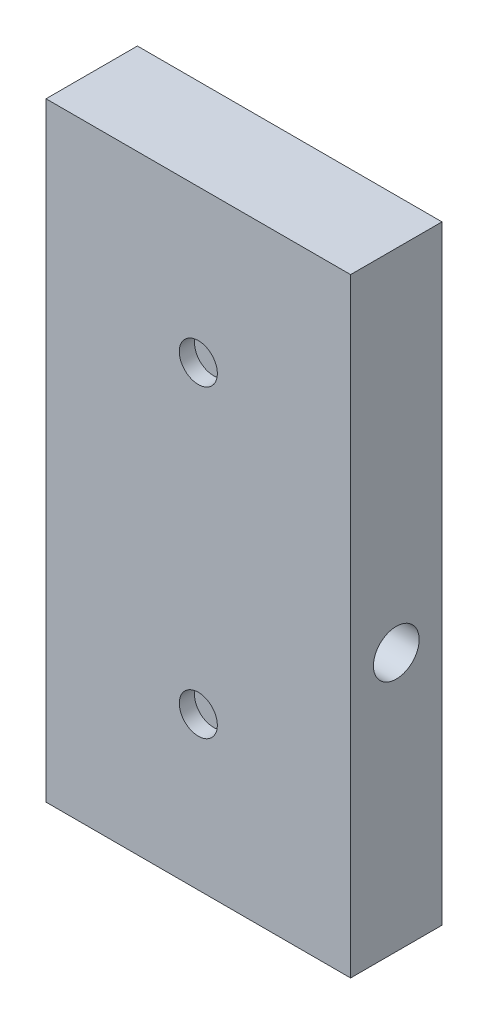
ISO-10303-21;
HEADER;
FILE_DESCRIPTION(('STEP AP214'),'2;1');
FILE_NAME('part.step','',(''),(''),'','','');
FILE_SCHEMA(('AUTOMOTIVE_DESIGN { 1 0 10303 214 1 1 1 1 }'));
ENDSEC;
DATA;
#1=APPLICATION_CONTEXT('core data for automotive mechanical design processes');
#2=APPLICATION_PROTOCOL_DEFINITION('international standard','automotive_design',2000,#1);
#3=PRODUCT_CONTEXT('',#1,'mechanical');
#4=PRODUCT('Part','Part','',(#3));
#5=PRODUCT_RELATED_PRODUCT_CATEGORY('part','',(#4));
#6=PRODUCT_DEFINITION_FORMATION('','',#4);
#7=PRODUCT_DEFINITION_CONTEXT('part definition',#1,'design');
#8=PRODUCT_DEFINITION('design','',#6,#7);
#9=PRODUCT_DEFINITION_SHAPE('','',#8);
#10=(LENGTH_UNIT() NAMED_UNIT(*) SI_UNIT(.MILLI.,.METRE.));
#11=(NAMED_UNIT(*) PLANE_ANGLE_UNIT() SI_UNIT($,.RADIAN.));
#12=(NAMED_UNIT(*) SI_UNIT($,.STERADIAN.) SOLID_ANGLE_UNIT());
#13=UNCERTAINTY_MEASURE_WITH_UNIT(LENGTH_MEASURE(1.E-05),#10,'distance_accuracy_value','');
#14=(GEOMETRIC_REPRESENTATION_CONTEXT(3) GLOBAL_UNCERTAINTY_ASSIGNED_CONTEXT((#13)) GLOBAL_UNIT_ASSIGNED_CONTEXT((#10,
#11,#12)) REPRESENTATION_CONTEXT('',''));
#15=CARTESIAN_POINT('',(0.,0.,0.));
#16=DIRECTION('',(0.,0.,1.));
#17=DIRECTION('',(1.,0.,0.));
#18=AXIS2_PLACEMENT_3D('',#15,#16,#17);
#19=CARTESIAN_POINT('',(-36.6811160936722,34.5313070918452,6.));
#20=DIRECTION('',(1.,0.,0.));
#21=DIRECTION('',(0.,1.,0.));
#22=AXIS2_PLACEMENT_3D('',#19,#20,#21);
#23=PLANE('',#22);
#24=DIRECTION('',(0.,-1.,0.));
#25=VECTOR('',#24,1.);
#26=CARTESIAN_POINT('',(-36.6811160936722,34.5313070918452,0.));
#27=LINE('',#26,#25);
#28=CARTESIAN_POINT('',(-36.6811160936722,34.5313070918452,0.));
#29=VERTEX_POINT('',#28);
#30=CARTESIAN_POINT('',(-36.6811160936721,-5.4686929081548,0.));
#31=VERTEX_POINT('',#30);
#32=EDGE_CURVE('E75',#29,#31,#27,.T.);
#33=ORIENTED_EDGE('',*,*,#32,.T.);
#34=DIRECTION('',(0.,0.,-1.));
#35=VECTOR('',#34,1.);
#36=CARTESIAN_POINT('',(-36.6811160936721,-5.4686929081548,6.));
#37=LINE('',#36,#35);
#38=CARTESIAN_POINT('',(-36.6811160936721,-5.4686929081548,6.));
#39=VERTEX_POINT('',#38);
#40=EDGE_CURVE('E11',#39,#31,#37,.T.);
#41=ORIENTED_EDGE('',*,*,#40,.F.);
#42=DIRECTION('',(0.,-1.,0.));
#43=VECTOR('',#42,1.);
#44=CARTESIAN_POINT('',(-36.6811160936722,34.5313070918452,6.));
#45=LINE('',#44,#43);
#46=CARTESIAN_POINT('',(-36.6811160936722,34.5313070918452,6.));
#47=VERTEX_POINT('',#46);
#48=EDGE_CURVE('E98',#47,#39,#45,.T.);
#49=ORIENTED_EDGE('',*,*,#48,.F.);
#50=DIRECTION('',(0.,0.,-1.));
#51=VECTOR('',#50,1.);
#52=CARTESIAN_POINT('',(-36.6811160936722,34.5313070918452,6.));
#53=LINE('',#52,#51);
#54=EDGE_CURVE('E87',#47,#29,#53,.T.);
#55=ORIENTED_EDGE('',*,*,#54,.T.);
#56=EDGE_LOOP('',(#33,#41,#49,#55));
#57=FACE_BOUND('',#56,.T.);
#58=ADVANCED_FACE('F26',(#57),#23,.F.);
#59=CARTESIAN_POINT('',(-36.6811160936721,-5.4686929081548,6.));
#60=DIRECTION('',(0.,1.,0.));
#61=DIRECTION('',(0.,0.,1.));
#62=AXIS2_PLACEMENT_3D('',#59,#60,#61);
#63=PLANE('',#62);
#64=DIRECTION('',(1.,0.,0.));
#65=VECTOR('',#64,1.);
#66=CARTESIAN_POINT('',(-36.6811160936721,-5.4686929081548,0.));
#67=LINE('',#66,#65);
#68=CARTESIAN_POINT('',(-16.6811160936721,-5.4686929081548,0.));
#69=VERTEX_POINT('',#68);
#70=EDGE_CURVE('E71',#31,#69,#67,.T.);
#71=ORIENTED_EDGE('',*,*,#70,.T.);
#72=DIRECTION('',(0.,0.,-1.));
#73=VECTOR('',#72,1.);
#74=CARTESIAN_POINT('',(-16.6811160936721,-5.4686929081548,6.));
#75=LINE('',#74,#73);
#76=CARTESIAN_POINT('',(-16.6811160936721,-5.4686929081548,6.));
#77=VERTEX_POINT('',#76);
#78=EDGE_CURVE('E38',#77,#69,#75,.T.);
#79=ORIENTED_EDGE('',*,*,#78,.F.);
#80=DIRECTION('',(1.,0.,0.));
#81=VECTOR('',#80,1.);
#82=CARTESIAN_POINT('',(-36.6811160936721,-5.4686929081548,6.));
#83=LINE('',#82,#81);
#84=EDGE_CURVE('E83',#39,#77,#83,.T.);
#85=ORIENTED_EDGE('',*,*,#84,.F.);
#86=ORIENTED_EDGE('',*,*,#40,.T.);
#87=EDGE_LOOP('',(#71,#79,#85,#86));
#88=FACE_BOUND('',#87,.T.);
#89=ADVANCED_FACE('F82',(#88),#63,.F.);
#90=CARTESIAN_POINT('',(-16.6811160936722,34.5313070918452,6.));
#91=DIRECTION('',(-1.,0.,0.));
#92=DIRECTION('',(0.,-1.,0.));
#93=AXIS2_PLACEMENT_3D('',#90,#91,#92);
#94=PLANE('',#93);
#95=CARTESIAN_POINT('',(-16.6811160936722,11.5313070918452,3.));
#96=DIRECTION('',(1.,0.,0.));
#97=DIRECTION('',(0.,1.,0.));
#98=AXIS2_PLACEMENT_3D('',#95,#96,#97);
#99=CIRCLE('',#98,1.5);
#100=CARTESIAN_POINT('',(-16.6811160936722,13.0313070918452,3.));
#101=VERTEX_POINT('',#100);
#102=EDGE_CURVE('E91',#101,#101,#99,.T.);
#103=ORIENTED_EDGE('',*,*,#102,.F.);
#104=EDGE_LOOP('',(#103));
#105=FACE_BOUND('',#104,.T.);
#106=DIRECTION('',(0.,1.,0.));
#107=VECTOR('',#106,1.);
#108=CARTESIAN_POINT('',(-16.6811160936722,34.5313070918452,0.));
#109=LINE('',#108,#107);
#110=CARTESIAN_POINT('',(-16.6811160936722,34.5313070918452,0.));
#111=VERTEX_POINT('',#110);
#112=EDGE_CURVE('E76',#69,#111,#109,.T.);
#113=ORIENTED_EDGE('',*,*,#112,.T.);
#114=DIRECTION('',(0.,0.,-1.));
#115=VECTOR('',#114,1.);
#116=CARTESIAN_POINT('',(-16.6811160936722,34.5313070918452,6.));
#117=LINE('',#116,#115);
#118=CARTESIAN_POINT('',(-16.6811160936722,34.5313070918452,6.));
#119=VERTEX_POINT('',#118);
#120=EDGE_CURVE('E104',#119,#111,#117,.T.);
#121=ORIENTED_EDGE('',*,*,#120,.F.);
#122=DIRECTION('',(0.,1.,0.));
#123=VECTOR('',#122,1.);
#124=CARTESIAN_POINT('',(-16.6811160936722,34.5313070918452,6.));
#125=LINE('',#124,#123);
#126=EDGE_CURVE('E50',#77,#119,#125,.T.);
#127=ORIENTED_EDGE('',*,*,#126,.F.);
#128=ORIENTED_EDGE('',*,*,#78,.T.);
#129=EDGE_LOOP('',(#113,#121,#127,#128));
#130=FACE_BOUND('',#129,.T.);
#131=ADVANCED_FACE('F108',(#105,#130),#94,.F.);
#132=CARTESIAN_POINT('',(-36.6811160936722,34.5313070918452,6.));
#133=DIRECTION('',(0.,-1.,0.));
#134=DIRECTION('',(0.,0.,-1.));
#135=AXIS2_PLACEMENT_3D('',#132,#133,#134);
#136=PLANE('',#135);
#137=DIRECTION('',(-1.,0.,0.));
#138=VECTOR('',#137,1.);
#139=CARTESIAN_POINT('',(-36.6811160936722,34.5313070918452,0.));
#140=LINE('',#139,#138);
#141=EDGE_CURVE('E96',#111,#29,#140,.T.);
#142=ORIENTED_EDGE('',*,*,#141,.T.);
#143=ORIENTED_EDGE('',*,*,#54,.F.);
#144=DIRECTION('',(-1.,0.,0.));
#145=VECTOR('',#144,1.);
#146=CARTESIAN_POINT('',(-36.6811160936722,34.5313070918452,6.));
#147=LINE('',#146,#145);
#148=EDGE_CURVE('E45',#119,#47,#147,.T.);
#149=ORIENTED_EDGE('',*,*,#148,.F.);
#150=ORIENTED_EDGE('',*,*,#120,.T.);
#151=EDGE_LOOP('',(#142,#143,#149,#150));
#152=FACE_BOUND('',#151,.T.);
#153=ADVANCED_FACE('F110',(#152),#136,.F.);
#154=CARTESIAN_POINT('',(-36.6811160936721,-5.4686929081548,6.));
#155=DIRECTION('',(0.,0.,1.));
#156=DIRECTION('',(1.,0.,0.));
#157=AXIS2_PLACEMENT_3D('',#154,#155,#156);
#158=PLANE('',#157);
#159=CARTESIAN_POINT('',(-26.6811160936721,24.5313070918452,6.));
#160=DIRECTION('',(0.,0.,1.));
#161=DIRECTION('',(1.,0.,0.));
#162=AXIS2_PLACEMENT_3D('',#159,#160,#161);
#163=CIRCLE('',#162,1.25);
#164=CARTESIAN_POINT('',(-25.4311160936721,24.5313070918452,6.));
#165=VERTEX_POINT('',#164);
#166=EDGE_CURVE('E164',#165,#165,#163,.T.);
#167=ORIENTED_EDGE('',*,*,#166,.F.);
#168=EDGE_LOOP('',(#167));
#169=FACE_BOUND('',#168,.T.);
#170=CARTESIAN_POINT('',(-26.6811160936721,4.5313070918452,6.));
#171=DIRECTION('',(0.,0.,1.));
#172=DIRECTION('',(1.,0.,0.));
#173=AXIS2_PLACEMENT_3D('',#170,#171,#172);
#174=CIRCLE('',#173,1.25);
#175=CARTESIAN_POINT('',(-25.4311160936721,4.5313070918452,6.));
#176=VERTEX_POINT('',#175);
#177=EDGE_CURVE('E158',#176,#176,#174,.T.);
#178=ORIENTED_EDGE('',*,*,#177,.F.);
#179=EDGE_LOOP('',(#178));
#180=FACE_BOUND('',#179,.T.);
#181=ORIENTED_EDGE('',*,*,#48,.T.);
#182=ORIENTED_EDGE('',*,*,#84,.T.);
#183=ORIENTED_EDGE('',*,*,#126,.T.);
#184=ORIENTED_EDGE('',*,*,#148,.T.);
#185=EDGE_LOOP('',(#181,#182,#183,#184));
#186=FACE_BOUND('',#185,.T.);
#187=ADVANCED_FACE('F111',(#169,#180,#186),#158,.T.);
#188=CARTESIAN_POINT('',(-36.6811160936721,-5.4686929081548,0.));
#189=DIRECTION('',(0.,0.,1.));
#190=DIRECTION('',(1.,0.,0.));
#191=AXIS2_PLACEMENT_3D('',#188,#189,#190);
#192=PLANE('',#191);
#193=CARTESIAN_POINT('',(-21.6811160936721,11.5313070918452,0.));
#194=DIRECTION('',(0.,0.,-1.));
#195=DIRECTION('',(-1.,0.,0.));
#196=AXIS2_PLACEMENT_3D('',#193,#194,#195);
#197=CIRCLE('',#196,1.);
#198=CARTESIAN_POINT('',(-22.6811160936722,11.5313070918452,0.));
#199=VERTEX_POINT('',#198);
#200=EDGE_CURVE('E167',#199,#199,#197,.T.);
#201=ORIENTED_EDGE('',*,*,#200,.F.);
#202=EDGE_LOOP('',(#201));
#203=FACE_BOUND('',#202,.T.);
#204=CARTESIAN_POINT('',(-26.6811160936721,31.5313070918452,0.));
#205=DIRECTION('',(0.,0.,-1.));
#206=DIRECTION('',(-1.,0.,0.));
#207=AXIS2_PLACEMENT_3D('',#204,#205,#206);
#208=CIRCLE('',#207,1.25);
#209=CARTESIAN_POINT('',(-27.9311160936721,31.5313070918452,0.));
#210=VERTEX_POINT('',#209);
#211=EDGE_CURVE('E152',#210,#210,#208,.T.);
#212=ORIENTED_EDGE('',*,*,#211,.F.);
#213=EDGE_LOOP('',(#212));
#214=FACE_BOUND('',#213,.T.);
#215=CARTESIAN_POINT('',(-26.6811160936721,-2.4686929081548,0.));
#216=DIRECTION('',(0.,0.,-1.));
#217=DIRECTION('',(-1.,0.,0.));
#218=AXIS2_PLACEMENT_3D('',#215,#216,#217);
#219=CIRCLE('',#218,1.25);
#220=CARTESIAN_POINT('',(-27.9311160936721,-2.4686929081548,0.));
#221=VERTEX_POINT('',#220);
#222=EDGE_CURVE('E144',#221,#221,#219,.T.);
#223=ORIENTED_EDGE('',*,*,#222,.F.);
#224=EDGE_LOOP('',(#223));
#225=FACE_BOUND('',#224,.T.);
#226=ORIENTED_EDGE('',*,*,#32,.F.);
#227=ORIENTED_EDGE('',*,*,#141,.F.);
#228=ORIENTED_EDGE('',*,*,#112,.F.);
#229=ORIENTED_EDGE('',*,*,#70,.F.);
#230=EDGE_LOOP('',(#226,#227,#228,#229));
#231=FACE_BOUND('',#230,.T.);
#232=ADVANCED_FACE('F72',(#203,#214,#225,#231),#192,.F.);
#233=CARTESIAN_POINT('',(-26.6811160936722,11.5313070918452,3.));
#234=DIRECTION('',(1.,0.,0.));
#235=DIRECTION('',(0.,1.,0.));
#236=AXIS2_PLACEMENT_3D('',#233,#234,#235);
#237=CYLINDRICAL_SURFACE('',#236,1.5);
#238=CARTESIAN_POINT('',(-22.6811160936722,11.5313070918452,1.5));
#239=CARTESIAN_POINT('',(-22.6811163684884,11.5815494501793,1.49999979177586));
#240=CARTESIAN_POINT('',(-22.6773091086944,11.6317916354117,1.50254598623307));
#241=CARTESIAN_POINT('',(-22.6623176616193,11.730673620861,1.51247673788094));
#242=CARTESIAN_POINT('',(-22.6511299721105,11.7793126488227,1.51986359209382));
#243=CARTESIAN_POINT('',(-22.6220622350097,11.8734132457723,1.53874758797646));
#244=CARTESIAN_POINT('',(-22.6042135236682,11.918888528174,1.55022547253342));
#245=CARTESIAN_POINT('',(-22.5625844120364,12.0060147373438,1.57636931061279));
#246=CARTESIAN_POINT('',(-22.5388031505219,12.04766510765,1.59103572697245));
#247=CARTESIAN_POINT('',(-22.4837876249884,12.1299494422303,1.62386335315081));
#248=CARTESIAN_POINT('',(-22.4520921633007,12.1701972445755,1.6422155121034));
#249=CARTESIAN_POINT('',(-22.3832510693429,12.2451711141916,1.68008843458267));
#250=CARTESIAN_POINT('',(-22.3460976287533,12.2798891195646,1.69961084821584));
#251=CARTESIAN_POINT('',(-22.2605899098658,12.3484185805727,1.74135867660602));
#252=CARTESIAN_POINT('',(-22.2113932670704,12.381223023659,1.763524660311));
#253=CARTESIAN_POINT('',(-22.1069344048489,12.4380588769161,1.80457926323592));
#254=CARTESIAN_POINT('',(-22.0516828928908,12.4621054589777,1.82347352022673));
#255=CARTESIAN_POINT('',(-21.9527604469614,12.4946772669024,1.85011866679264));
#256=CARTESIAN_POINT('',(-21.9103518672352,12.5056793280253,1.85951186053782));
#257=CARTESIAN_POINT('',(-21.8237438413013,12.5220601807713,1.87371015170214));
#258=CARTESIAN_POINT('',(-21.779547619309,12.5274486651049,1.87852315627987));
#259=CARTESIAN_POINT('',(-21.6903787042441,12.5322639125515,1.88281697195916));
#260=CARTESIAN_POINT('',(-21.6454035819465,12.5316663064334,1.88227598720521));
#261=CARTESIAN_POINT('',(-21.5562986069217,12.5244949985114,1.87590112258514));
#262=CARTESIAN_POINT('',(-21.5121695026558,12.517916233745,1.87006275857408));
#263=CARTESIAN_POINT('',(-21.4278825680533,12.4996320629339,1.85436407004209));
#264=CARTESIAN_POINT('',(-21.3876354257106,12.4881656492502,1.84469255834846));
#265=CARTESIAN_POINT('',(-21.3096042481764,12.4606576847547,1.82245188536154));
#266=CARTESIAN_POINT('',(-21.2718210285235,12.4446146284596,1.80988177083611));
#267=CARTESIAN_POINT('',(-21.191603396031,12.4046761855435,1.78017901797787));
#268=CARTESIAN_POINT('',(-21.1497861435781,12.379847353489,1.76263841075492));
#269=CARTESIAN_POINT('',(-21.0704243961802,12.3246518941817,1.72654231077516));
#270=CARTESIAN_POINT('',(-21.032885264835,12.2942784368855,1.70798558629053));
#271=CARTESIAN_POINT('',(-20.9548448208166,12.2212129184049,1.66728328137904));
#272=CARTESIAN_POINT('',(-20.9154490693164,12.1772767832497,1.64522627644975));
#273=CARTESIAN_POINT('',(-20.8445178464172,12.082311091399,1.60390949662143));
#274=CARTESIAN_POINT('',(-20.8129750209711,12.0312882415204,1.58464711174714));
#275=CARTESIAN_POINT('',(-20.7643772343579,11.9337360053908,1.55427297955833));
#276=CARTESIAN_POINT('',(-20.7456944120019,11.8882859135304,1.54230369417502));
#277=CARTESIAN_POINT('',(-20.7150636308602,11.7943251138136,1.52246140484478));
#278=CARTESIAN_POINT('',(-20.7031099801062,11.7458170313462,1.51458493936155));
#279=CARTESIAN_POINT('',(-20.6865355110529,11.6467998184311,1.50362058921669));
#280=CARTESIAN_POINT('',(-20.681946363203,11.5962829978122,1.50055338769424));
#281=CARTESIAN_POINT('',(-20.6804925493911,11.4950863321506,1.49958442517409));
#282=CARTESIAN_POINT('',(-20.6836273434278,11.4444064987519,1.50168230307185));
#283=CARTESIAN_POINT('',(-20.6969281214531,11.348079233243,1.51050205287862));
#284=CARTESIAN_POINT('',(-20.7065847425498,11.3023283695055,1.51688876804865));
#285=CARTESIAN_POINT('',(-20.7319139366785,11.2132488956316,1.53340775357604));
#286=CARTESIAN_POINT('',(-20.7475874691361,11.1699206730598,1.54354062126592));
#287=CARTESIAN_POINT('',(-20.7854422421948,11.083974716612,1.5675182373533));
#288=CARTESIAN_POINT('',(-20.8079601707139,11.0415589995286,1.58155064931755));
#289=CARTESIAN_POINT('',(-20.8583327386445,10.9609655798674,1.61199072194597));
#290=CARTESIAN_POINT('',(-20.8861906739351,10.9227905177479,1.62839984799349));
#291=CARTESIAN_POINT('',(-20.9514200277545,10.8453798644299,1.66522726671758));
#292=CARTESIAN_POINT('',(-20.9895992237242,10.8069311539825,1.68586921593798));
#293=CARTESIAN_POINT('',(-21.0716718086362,10.7366372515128,1.72714413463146));
#294=CARTESIAN_POINT('',(-21.1155691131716,10.7047966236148,1.74777708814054));
#295=CARTESIAN_POINT('',(-21.2046873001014,10.6506832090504,1.78530160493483));
#296=CARTESIAN_POINT('',(-21.249482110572,10.6278289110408,1.80236201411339));
#297=CARTESIAN_POINT('',(-21.3430524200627,10.5888260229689,1.83280512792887));
#298=CARTESIAN_POINT('',(-21.3918205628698,10.5726653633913,1.8461944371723));
#299=CARTESIAN_POINT('',(-21.4833983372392,10.5501278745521,1.86533395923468));
#300=CARTESIAN_POINT('',(-21.5257019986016,10.5425141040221,1.87202500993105));
#301=CARTESIAN_POINT('',(-21.6114027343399,10.5328110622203,1.88060266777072));
#302=CARTESIAN_POINT('',(-21.6547985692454,10.53071579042,1.88249449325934));
#303=CARTESIAN_POINT('',(-21.7414376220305,10.5321874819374,1.88117899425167));
#304=CARTESIAN_POINT('',(-21.7846807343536,10.5357577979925,1.87796865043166));
#305=CARTESIAN_POINT('',(-21.8697878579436,10.5483221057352,1.8669477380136));
#306=CARTESIAN_POINT('',(-21.9116499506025,10.5573233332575,1.85913103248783));
#307=CARTESIAN_POINT('',(-22.0039716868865,10.5833419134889,1.8373657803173));
#308=CARTESIAN_POINT('',(-22.0537499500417,10.6018561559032,1.82233833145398));
#309=CARTESIAN_POINT('',(-22.1488595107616,10.6458844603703,1.78888919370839));
#310=CARTESIAN_POINT('',(-22.1941844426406,10.6714083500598,1.77046275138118));
#311=CARTESIAN_POINT('',(-22.280757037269,10.7293156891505,1.73191406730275));
#312=CARTESIAN_POINT('',(-22.3219154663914,10.7618155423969,1.7117670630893));
#313=CARTESIAN_POINT('',(-22.3987773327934,10.8329482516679,1.67185849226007));
#314=CARTESIAN_POINT('',(-22.4344790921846,10.8715829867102,1.6520970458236));
#315=CARTESIAN_POINT('',(-22.5044721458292,10.9605784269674,1.61184224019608));
#316=CARTESIAN_POINT('',(-22.537825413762,11.0118262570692,1.59165097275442));
#317=CARTESIAN_POINT('',(-22.5950727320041,11.1208728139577,1.55611167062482));
#318=CARTESIAN_POINT('',(-22.618981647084,11.1786610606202,1.54075603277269));
#319=CARTESIAN_POINT('',(-22.6516933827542,11.2855895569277,1.51949177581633));
#320=CARTESIAN_POINT('',(-22.6626716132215,11.3338009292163,1.51224259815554));
#321=CARTESIAN_POINT('',(-22.6773801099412,11.4317780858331,1.50249859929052));
#322=CARTESIAN_POINT('',(-22.6811158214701,11.4815426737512,1.50000020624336));
#323=CARTESIAN_POINT('',(-22.6811160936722,11.5313070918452,1.5));
#324=B_SPLINE_CURVE_WITH_KNOTS('',3,(#238,#239,#240,#241,#242,#243,#244,#245,#246,#247,#248,
#249,#250,#251,#252,#253,#254,#255,#256,#257,#258,#259,#260,#261,#262,#263,#264,#265,#266,#267,
#268,#269,#270,#271,#272,#273,#274,#275,#276,#277,#278,#279,#280,#281,#282,#283,#284,#285,#286,
#287,#288,#289,#290,#291,#292,#293,#294,#295,#296,#297,#298,#299,#300,#301,#302,#303,#304,#305,
#306,#307,#308,#309,#310,#311,#312,#313,#314,#315,#316,#317,#318,#319,#320,#321,#322,#323),
.UNSPECIFIED.,.T.,.F.,(4,2,2,2,2,2,2,2,2,2,2,2,2,2,2,2,2,2,2,2,2,2,2,2,2,2,2,2,2,2,2,2,2,2,2,2,
2,2,2,2,2,2,4),(0.,0.150526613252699,0.301124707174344,0.451023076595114,0.600943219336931,
0.763585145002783,0.926462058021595,1.11503341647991,1.3032765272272,1.43716846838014,
1.57082883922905,1.7050335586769,1.83935198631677,1.96774431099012,2.09617891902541,
2.25073787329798,2.40548851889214,2.59359477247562,2.78152420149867,2.93262043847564,
3.08358867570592,3.23520441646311,3.38680955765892,3.52776542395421,3.6687437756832,
3.81826173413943,3.96787227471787,4.14114088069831,4.31452876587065,4.47324967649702,
4.63168313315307,4.76162024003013,4.89141600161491,5.02128860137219,5.15133461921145,
5.31603304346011,5.48096356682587,5.64889622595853,5.81688041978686,6.00897675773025,
6.20076953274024,6.34997645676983,6.49907115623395),.UNSPECIFIED.);
#325=CARTESIAN_POINT('',(-22.6811160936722,11.5313070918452,1.5));
#326=VERTEX_POINT('',#325);
#327=EDGE_CURVE('E29',#326,#326,#324,.T.);
#328=ORIENTED_EDGE('',*,*,#327,.T.);
#329=EDGE_LOOP('',(#328));
#330=FACE_BOUND('',#329,.T.);
#331=CARTESIAN_POINT('',(-26.6811160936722,11.5313070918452,3.));
#332=DIRECTION('',(1.,0.,0.));
#333=DIRECTION('',(0.,1.,0.));
#334=AXIS2_PLACEMENT_3D('',#331,#332,#333);
#335=CIRCLE('',#334,1.5);
#336=CARTESIAN_POINT('',(-26.6811160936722,13.0313070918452,3.));
#337=VERTEX_POINT('',#336);
#338=EDGE_CURVE('E88',#337,#337,#335,.T.);
#339=ORIENTED_EDGE('',*,*,#338,.F.);
#340=EDGE_LOOP('',(#339));
#341=FACE_BOUND('',#340,.T.);
#342=ORIENTED_EDGE('',*,*,#102,.T.);
#343=EDGE_LOOP('',(#342));
#344=FACE_BOUND('',#343,.T.);
#345=ADVANCED_FACE('F120',(#330,#341,#344),#237,.F.);
#346=CARTESIAN_POINT('',(-26.6811160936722,11.5313070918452,3.));
#347=DIRECTION('',(1.,0.,0.));
#348=DIRECTION('',(0.,1.,0.));
#349=AXIS2_PLACEMENT_3D('',#346,#347,#348);
#350=PLANE('',#349);
#351=ORIENTED_EDGE('',*,*,#338,.T.);
#352=EDGE_LOOP('',(#351));
#353=FACE_BOUND('',#352,.T.);
#354=ADVANCED_FACE('F212',(#353),#350,.T.);
#355=CARTESIAN_POINT('',(-26.6811160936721,-2.4686929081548,1.));
#356=DIRECTION('',(0.,0.,-1.));
#357=DIRECTION('',(-1.,0.,0.));
#358=AXIS2_PLACEMENT_3D('',#355,#356,#357);
#359=CYLINDRICAL_SURFACE('',#358,1.25);
#360=CARTESIAN_POINT('',(-26.6811160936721,-2.4686929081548,1.));
#361=DIRECTION('',(0.,0.,-1.));
#362=DIRECTION('',(-1.,0.,0.));
#363=AXIS2_PLACEMENT_3D('',#360,#361,#362);
#364=CIRCLE('',#363,1.25);
#365=CARTESIAN_POINT('',(-27.9311160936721,-2.4686929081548,1.));
#366=VERTEX_POINT('',#365);
#367=EDGE_CURVE('E142',#366,#366,#364,.T.);
#368=ORIENTED_EDGE('',*,*,#367,.F.);
#369=EDGE_LOOP('',(#368));
#370=FACE_BOUND('',#369,.T.);
#371=ORIENTED_EDGE('',*,*,#222,.T.);
#372=EDGE_LOOP('',(#371));
#373=FACE_BOUND('',#372,.T.);
#374=ADVANCED_FACE('F208',(#370,#373),#359,.F.);
#375=CARTESIAN_POINT('',(-26.6811160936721,-2.4686929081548,1.));
#376=DIRECTION('',(0.,0.,-1.));
#377=DIRECTION('',(-1.,0.,0.));
#378=AXIS2_PLACEMENT_3D('',#375,#376,#377);
#379=PLANE('',#378);
#380=ORIENTED_EDGE('',*,*,#367,.T.);
#381=EDGE_LOOP('',(#380));
#382=FACE_BOUND('',#381,.T.);
#383=ADVANCED_FACE('F204',(#382),#379,.T.);
#384=CARTESIAN_POINT('',(-26.6811160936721,31.5313070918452,1.));
#385=DIRECTION('',(0.,0.,-1.));
#386=DIRECTION('',(-1.,0.,0.));
#387=AXIS2_PLACEMENT_3D('',#384,#385,#386);
#388=CYLINDRICAL_SURFACE('',#387,1.25);
#389=CARTESIAN_POINT('',(-26.6811160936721,31.5313070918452,1.));
#390=DIRECTION('',(0.,0.,-1.));
#391=DIRECTION('',(-1.,0.,0.));
#392=AXIS2_PLACEMENT_3D('',#389,#390,#391);
#393=CIRCLE('',#392,1.25);
#394=CARTESIAN_POINT('',(-27.9311160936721,31.5313070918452,1.));
#395=VERTEX_POINT('',#394);
#396=EDGE_CURVE('E149',#395,#395,#393,.T.);
#397=ORIENTED_EDGE('',*,*,#396,.F.);
#398=EDGE_LOOP('',(#397));
#399=FACE_BOUND('',#398,.T.);
#400=ORIENTED_EDGE('',*,*,#211,.T.);
#401=EDGE_LOOP('',(#400));
#402=FACE_BOUND('',#401,.T.);
#403=ADVANCED_FACE('F200',(#399,#402),#388,.F.);
#404=CARTESIAN_POINT('',(-26.6811160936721,31.5313070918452,1.));
#405=DIRECTION('',(0.,0.,-1.));
#406=DIRECTION('',(-1.,0.,0.));
#407=AXIS2_PLACEMENT_3D('',#404,#405,#406);
#408=PLANE('',#407);
#409=ORIENTED_EDGE('',*,*,#396,.T.);
#410=EDGE_LOOP('',(#409));
#411=FACE_BOUND('',#410,.T.);
#412=ADVANCED_FACE('F197',(#411),#408,.T.);
#413=CARTESIAN_POINT('',(-26.6811160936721,4.5313070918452,5.));
#414=DIRECTION('',(0.,0.,1.));
#415=DIRECTION('',(1.,0.,0.));
#416=AXIS2_PLACEMENT_3D('',#413,#414,#415);
#417=CYLINDRICAL_SURFACE('',#416,1.25);
#418=CARTESIAN_POINT('',(-26.6811160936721,4.5313070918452,5.));
#419=DIRECTION('',(0.,0.,1.));
#420=DIRECTION('',(1.,0.,0.));
#421=AXIS2_PLACEMENT_3D('',#418,#419,#420);
#422=CIRCLE('',#421,1.25);
#423=CARTESIAN_POINT('',(-25.4311160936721,4.5313070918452,5.));
#424=VERTEX_POINT('',#423);
#425=EDGE_CURVE('E155',#424,#424,#422,.T.);
#426=ORIENTED_EDGE('',*,*,#425,.F.);
#427=EDGE_LOOP('',(#426));
#428=FACE_BOUND('',#427,.T.);
#429=ORIENTED_EDGE('',*,*,#177,.T.);
#430=EDGE_LOOP('',(#429));
#431=FACE_BOUND('',#430,.T.);
#432=ADVANCED_FACE('F194',(#428,#431),#417,.F.);
#433=CARTESIAN_POINT('',(-26.6811160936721,4.5313070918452,5.));
#434=DIRECTION('',(0.,0.,1.));
#435=DIRECTION('',(1.,0.,0.));
#436=AXIS2_PLACEMENT_3D('',#433,#434,#435);
#437=PLANE('',#436);
#438=ORIENTED_EDGE('',*,*,#425,.T.);
#439=EDGE_LOOP('',(#438));
#440=FACE_BOUND('',#439,.T.);
#441=ADVANCED_FACE('F190',(#440),#437,.T.);
#442=CARTESIAN_POINT('',(-26.6811160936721,24.5313070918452,5.));
#443=DIRECTION('',(0.,0.,1.));
#444=DIRECTION('',(1.,0.,0.));
#445=AXIS2_PLACEMENT_3D('',#442,#443,#444);
#446=CYLINDRICAL_SURFACE('',#445,1.25);
#447=CARTESIAN_POINT('',(-26.6811160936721,24.5313070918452,5.));
#448=DIRECTION('',(0.,0.,1.));
#449=DIRECTION('',(1.,0.,0.));
#450=AXIS2_PLACEMENT_3D('',#447,#448,#449);
#451=CIRCLE('',#450,1.25);
#452=CARTESIAN_POINT('',(-25.4311160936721,24.5313070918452,5.));
#453=VERTEX_POINT('',#452);
#454=EDGE_CURVE('E161',#453,#453,#451,.T.);
#455=ORIENTED_EDGE('',*,*,#454,.F.);
#456=EDGE_LOOP('',(#455));
#457=FACE_BOUND('',#456,.T.);
#458=ORIENTED_EDGE('',*,*,#166,.T.);
#459=EDGE_LOOP('',(#458));
#460=FACE_BOUND('',#459,.T.);
#461=ADVANCED_FACE('F183',(#457,#460),#446,.F.);
#462=CARTESIAN_POINT('',(-26.6811160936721,24.5313070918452,5.));
#463=DIRECTION('',(0.,0.,1.));
#464=DIRECTION('',(1.,0.,0.));
#465=AXIS2_PLACEMENT_3D('',#462,#463,#464);
#466=PLANE('',#465);
#467=ORIENTED_EDGE('',*,*,#454,.T.);
#468=EDGE_LOOP('',(#467));
#469=FACE_BOUND('',#468,.T.);
#470=ADVANCED_FACE('F178',(#469),#466,.T.);
#471=CARTESIAN_POINT('',(-21.6811160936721,11.5313070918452,2.));
#472=DIRECTION('',(0.,0.,-1.));
#473=DIRECTION('',(-1.,0.,0.));
#474=AXIS2_PLACEMENT_3D('',#471,#472,#473);
#475=CYLINDRICAL_SURFACE('',#474,1.);
#476=ORIENTED_EDGE('',*,*,#200,.T.);
#477=EDGE_LOOP('',(#476));
#478=FACE_BOUND('',#477,.T.);
#479=ORIENTED_EDGE('',*,*,#327,.F.);
#480=EDGE_LOOP('',(#479));
#481=FACE_BOUND('',#480,.T.);
#482=ADVANCED_FACE('F176',(#478,#481),#475,.F.);
#483=CLOSED_SHELL('',(#58,#89,#131,#153,#187,#232,#345,#354,#374,#383,#403,#412,#432,#441,#461,
#470,#482));
#484=MANIFOLD_SOLID_BREP('B2',#483);
#485=ADVANCED_BREP_SHAPE_REPRESENTATION('',(#18,#484),#14);
#486=SHAPE_DEFINITION_REPRESENTATION(#9,#485);
ENDSEC;
END-ISO-10303-21;
